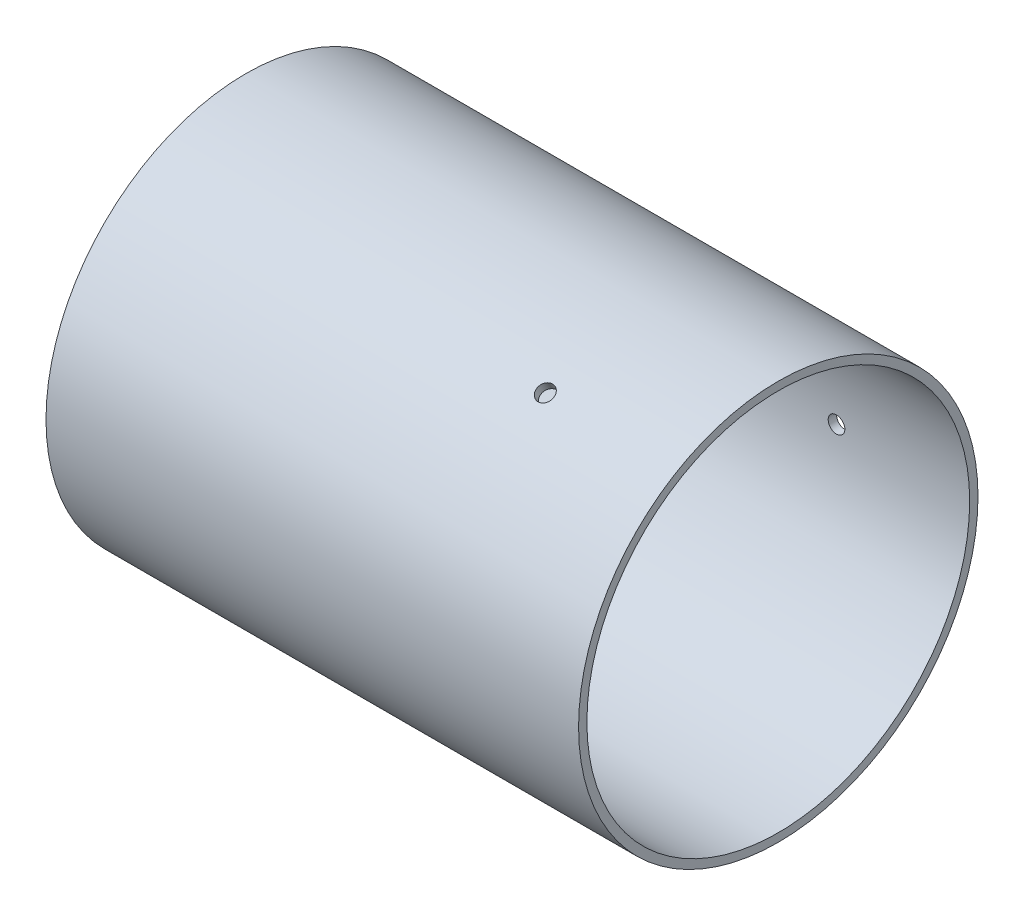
from build123d import *

# Parameters (mm, degrees)
SKETCH1_R          = 38.1
SKETCH1_R_2        = 36.5125
EXTRUDE1_DEPTH     = 101.6
SKETCH3_R          = 1.5875
CUT_EXTRUDE1_DEPTH = 116.003391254
SKETCH4_R          = 1.5875
CUT_EXTRUDE2_DEPTH = 116.003391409
SKETCH5_R          = 1.5875
CUT_EXTRUDE3_DEPTH = 116.003391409


with BuildPart() as part:
    # Sketch1 → Extrude1 (new body)
    with BuildSketch(Plane(origin=(0, 0, 0), x_dir=(0, 0, -1), z_dir=(1, 0, 0))):
        Circle(SKETCH1_R)
        Circle(SKETCH1_R_2, mode=Mode.SUBTRACT)
    extrude(amount=EXTRUDE1_DEPTH)

    # Sketch3 → Cut-Extrude1 (cut, through all)
    with BuildSketch(Plane.XY):
        with Locations((76.2, 0)):
            Circle(SKETCH3_R)
    extrude(amount=-CUT_EXTRUDE1_DEPTH, mode=Mode.SUBTRACT)

    # Sketch4 → Cut-Extrude2 (cut, through all)
    with BuildSketch(Plane(origin=(0, 0, 0), x_dir=(1, 0, 0), z_dir=(0, -0.8660254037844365, -0.500000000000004))):
        with Locations(Location((76.2, 0, 0), (0, 0, 270))):
            Circle(SKETCH4_R)
    extrude(amount=-CUT_EXTRUDE2_DEPTH, mode=Mode.SUBTRACT)

    # Sketch5 → Cut-Extrude3 (cut, through all)
    with BuildSketch(Plane(origin=(0, 0, 0), x_dir=(-1, 0, 0), z_dir=(0, 0.8660254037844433, -0.49999999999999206))):
        with Locations(Location((-76.2, 0, 0), (0, 0, 90))):
            Circle(SKETCH5_R)
    extrude(amount=-CUT_EXTRUDE3_DEPTH, mode=Mode.SUBTRACT)


solid = part.part
